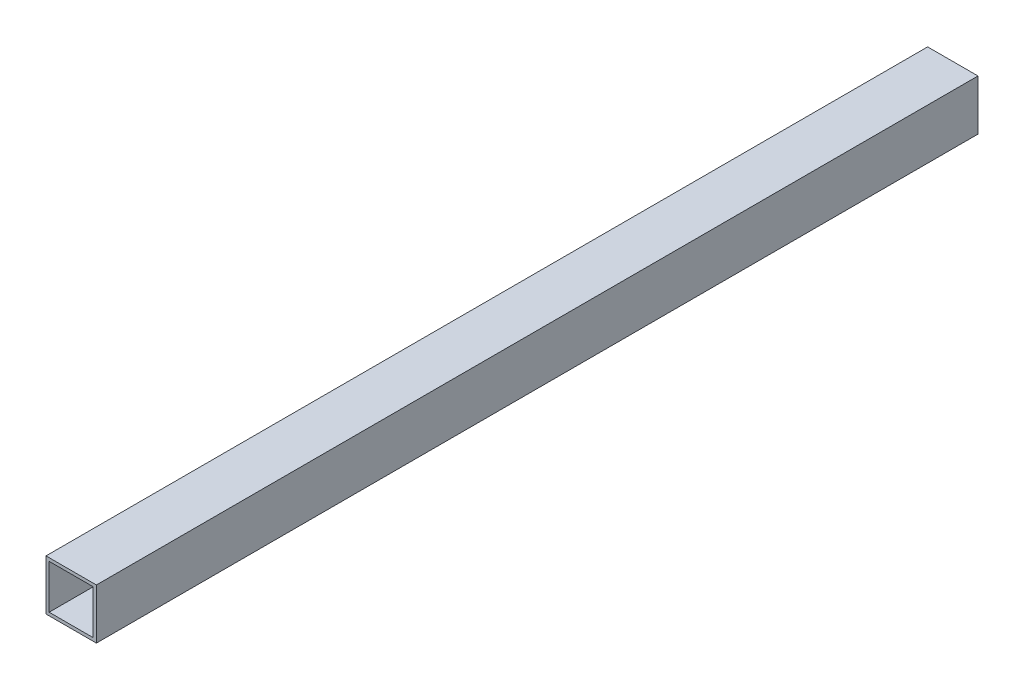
from build123d import *

# Parameters (mm, degrees)
SKETCH1_W           = 25.4
SKETCH1_H           = 25.4
SKETCH1_W_2         = 22.225
SKETCH1_H_2         = 22.225
BOSS_EXTRUDE1_DEPTH = 444.5


with BuildPart() as part:
    # Sketch1 → Boss-Extrude1 (new body)
    with BuildSketch(Plane.XY):
        with Locations((12.7, 12.7)):
            Rectangle(SKETCH1_W, SKETCH1_H)
        with Locations((12.7, 12.7)):
            Rectangle(SKETCH1_W_2, SKETCH1_H_2, mode=Mode.SUBTRACT)
    extrude(amount=BOSS_EXTRUDE1_DEPTH)


solid = part.part
